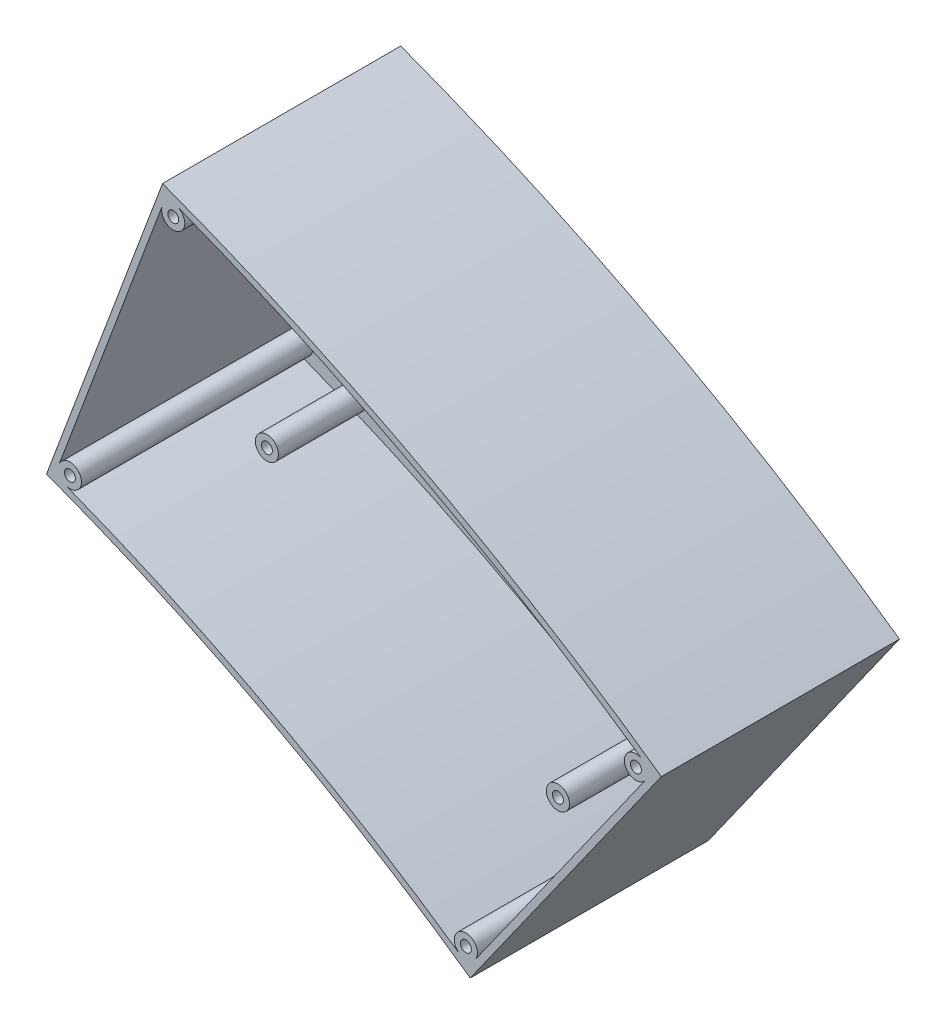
ISO-10303-21;
HEADER;
FILE_DESCRIPTION(('STEP AP214'),'2;1');
FILE_NAME('part.step','',(''),(''),'','','');
FILE_SCHEMA(('AUTOMOTIVE_DESIGN { 1 0 10303 214 1 1 1 1 }'));
ENDSEC;
DATA;
#1=APPLICATION_CONTEXT('core data for automotive mechanical design processes');
#2=APPLICATION_PROTOCOL_DEFINITION('international standard','automotive_design',2000,#1);
#3=PRODUCT_CONTEXT('',#1,'mechanical');
#4=PRODUCT('Part','Part','',(#3));
#5=PRODUCT_RELATED_PRODUCT_CATEGORY('part','',(#4));
#6=PRODUCT_DEFINITION_FORMATION('','',#4);
#7=PRODUCT_DEFINITION_CONTEXT('part definition',#1,'design');
#8=PRODUCT_DEFINITION('design','',#6,#7);
#9=PRODUCT_DEFINITION_SHAPE('','',#8);
#10=(LENGTH_UNIT() NAMED_UNIT(*) SI_UNIT(.MILLI.,.METRE.));
#11=(NAMED_UNIT(*) PLANE_ANGLE_UNIT() SI_UNIT($,.RADIAN.));
#12=(NAMED_UNIT(*) SI_UNIT($,.STERADIAN.) SOLID_ANGLE_UNIT());
#13=UNCERTAINTY_MEASURE_WITH_UNIT(LENGTH_MEASURE(1.E-05),#10,'distance_accuracy_value','');
#14=(GEOMETRIC_REPRESENTATION_CONTEXT(3) GLOBAL_UNCERTAINTY_ASSIGNED_CONTEXT((#13)) GLOBAL_UNIT_ASSIGNED_CONTEXT((#10,
#11,#12)) REPRESENTATION_CONTEXT('',''));
#15=CARTESIAN_POINT('',(0.,0.,0.));
#16=DIRECTION('',(0.,0.,1.));
#17=DIRECTION('',(1.,0.,0.));
#18=AXIS2_PLACEMENT_3D('',#15,#16,#17);
#19=CARTESIAN_POINT('',(0.,0.,0.));
#20=DIRECTION('',(0.,0.,1.));
#21=DIRECTION('',(1.,0.,0.));
#22=AXIS2_PLACEMENT_3D('',#19,#20,#21);
#23=PLANE('',#22);
#24=DIRECTION('',(0.,1.,0.));
#25=VECTOR('',#24,1.);
#26=CARTESIAN_POINT('',(303.833830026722,553.411442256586,0.));
#27=LINE('',#26,#25);
#28=CARTESIAN_POINT('',(303.833830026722,533.411442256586,0.));
#29=VERTEX_POINT('',#28);
#30=CARTESIAN_POINT('',(303.833830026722,553.411442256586,0.));
#31=VERTEX_POINT('',#30);
#32=EDGE_CURVE('E81',#29,#31,#27,.T.);
#33=ORIENTED_EDGE('',*,*,#32,.F.);
#34=DIRECTION('',(1.,0.,0.));
#35=VECTOR('',#34,1.);
#36=CARTESIAN_POINT('',(303.833830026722,533.411442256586,0.));
#37=LINE('',#36,#35);
#38=CARTESIAN_POINT('',(283.833830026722,533.411442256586,0.));
#39=VERTEX_POINT('',#38);
#40=EDGE_CURVE('E197',#39,#29,#37,.T.);
#41=ORIENTED_EDGE('',*,*,#40,.F.);
#42=DIRECTION('',(0.,-1.,0.));
#43=VECTOR('',#42,1.);
#44=CARTESIAN_POINT('',(283.833830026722,553.411442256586,0.));
#45=LINE('',#44,#43);
#46=CARTESIAN_POINT('',(283.833830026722,553.411442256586,0.));
#47=VERTEX_POINT('',#46);
#48=EDGE_CURVE('E182',#47,#39,#45,.T.);
#49=ORIENTED_EDGE('',*,*,#48,.F.);
#50=DIRECTION('',(-1.,0.,0.));
#51=VECTOR('',#50,1.);
#52=CARTESIAN_POINT('',(303.833830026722,553.411442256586,0.));
#53=LINE('',#52,#51);
#54=EDGE_CURVE('E191',#31,#47,#53,.T.);
#55=ORIENTED_EDGE('',*,*,#54,.F.);
#56=EDGE_LOOP('',(#33,#41,#49,#55));
#57=FACE_BOUND('',#56,.T.);
#58=CARTESIAN_POINT('',(326.244320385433,507.651110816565,0.));
#59=DIRECTION('',(0.,0.,1.));
#60=DIRECTION('',(1.,0.,0.));
#61=AXIS2_PLACEMENT_3D('',#58,#59,#60);
#62=CIRCLE('',#61,3.19999999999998);
#63=CARTESIAN_POINT('',(329.444320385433,507.651110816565,0.));
#64=VERTEX_POINT('',#63);
#65=EDGE_CURVE('E207',#64,#64,#62,.T.);
#66=ORIENTED_EDGE('',*,*,#65,.F.);
#67=EDGE_LOOP('',(#66));
#68=FACE_BOUND('',#67,.T.);
#69=CARTESIAN_POINT('',(237.442513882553,556.568323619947,0.));
#70=DIRECTION('',(0.,0.,1.));
#71=DIRECTION('',(1.,0.,0.));
#72=AXIS2_PLACEMENT_3D('',#69,#70,#71);
#73=CIRCLE('',#72,3.19999999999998);
#74=CARTESIAN_POINT('',(240.642513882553,556.568323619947,0.));
#75=VERTEX_POINT('',#74);
#76=EDGE_CURVE('E204',#75,#75,#73,.T.);
#77=ORIENTED_EDGE('',*,*,#76,.F.);
#78=EDGE_LOOP('',(#77));
#79=FACE_BOUND('',#78,.T.);
#80=CARTESIAN_POINT('',(234.930988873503,539.25939051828,0.));
#81=DIRECTION('',(0.,0.,1.));
#82=DIRECTION('',(1.,0.,0.));
#83=AXIS2_PLACEMENT_3D('',#80,#81,#82);
#84=CIRCLE('',#83,3.50000000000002);
#85=CARTESIAN_POINT('',(238.430988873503,539.25939051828,0.));
#86=VERTEX_POINT('',#85);
#87=EDGE_CURVE('E305',#86,#86,#84,.T.);
#88=ORIENTED_EDGE('',*,*,#87,.F.);
#89=EDGE_LOOP('',(#88));
#90=FACE_BOUND('',#89,.T.);
#91=CARTESIAN_POINT('',(258.693599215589,583.251871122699,0.));
#92=DIRECTION('',(0.,0.,1.));
#93=DIRECTION('',(1.,0.,0.));
#94=AXIS2_PLACEMENT_3D('',#91,#92,#93);
#95=CIRCLE('',#94,3.50000000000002);
#96=CARTESIAN_POINT('',(262.193599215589,583.251871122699,0.));
#97=VERTEX_POINT('',#96);
#98=EDGE_CURVE('E311',#97,#97,#95,.T.);
#99=ORIENTED_EDGE('',*,*,#98,.F.);
#100=EDGE_LOOP('',(#99));
#101=FACE_BOUND('',#100,.T.);
#102=CARTESIAN_POINT('',(322.915950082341,491.734169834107,0.));
#103=DIRECTION('',(0.,0.,1.));
#104=DIRECTION('',(1.,0.,0.));
#105=AXIS2_PLACEMENT_3D('',#102,#103,#104);
#106=CIRCLE('',#105,3.50000000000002);
#107=CARTESIAN_POINT('',(326.415950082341,491.734169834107,0.));
#108=VERTEX_POINT('',#107);
#109=EDGE_CURVE('E317',#108,#108,#106,.T.);
#110=ORIENTED_EDGE('',*,*,#109,.F.);
#111=EDGE_LOOP('',(#110));
#112=FACE_BOUND('',#111,.T.);
#113=CARTESIAN_POINT('',(346.678560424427,535.726650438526,0.));
#114=DIRECTION('',(0.,0.,1.));
#115=DIRECTION('',(1.,0.,0.));
#116=AXIS2_PLACEMENT_3D('',#113,#114,#115);
#117=CIRCLE('',#116,3.50000000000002);
#118=CARTESIAN_POINT('',(350.178560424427,535.726650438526,0.));
#119=VERTEX_POINT('',#118);
#120=EDGE_CURVE('E320',#119,#119,#117,.T.);
#121=ORIENTED_EDGE('',*,*,#120,.F.);
#122=EDGE_LOOP('',(#121));
#123=FACE_BOUND('',#122,.T.);
#124=DIRECTION('',(-0.350968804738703,-0.936387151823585,0.));
#125=VECTOR('',#124,1.);
#126=CARTESIAN_POINT('',(235.267029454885,621.995518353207,0.));
#127=LINE('',#126,#125);
#128=CARTESIAN_POINT('',(233.328651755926,616.823913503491,0.));
#129=VERTEX_POINT('',#128);
#130=CARTESIAN_POINT('',(202.091172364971,533.482106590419,0.));
#131=VERTEX_POINT('',#130);
#132=EDGE_CURVE('E342',#129,#131,#127,.T.);
#133=ORIENTED_EDGE('',*,*,#132,.T.);
#134=CARTESIAN_POINT('',(205.368527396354,532.253715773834,0.));
#135=DIRECTION('',(0.,0.,1.));
#136=DIRECTION('',(1.,0.,0.));
#137=AXIS2_PLACEMENT_3D('',#134,#135,#136);
#138=CIRCLE('',#137,3.49999999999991);
#139=CARTESIAN_POINT('',(204.108597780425,528.988355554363,0.));
#140=VERTEX_POINT('',#139);
#141=EDGE_CURVE('E244',#140,#131,#138,.T.);
#142=ORIENTED_EDGE('',*,*,#141,.F.);
#143=CARTESIAN_POINT('',(1.36002320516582E-12,3.44169137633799E-12,0.));
#144=DIRECTION('',(0.,0.,1.));
#145=DIRECTION('',(1.,0.,0.));
#146=AXIS2_PLACEMENT_3D('',#143,#144,#145);
#147=CIRCLE('',#146,566.999999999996);
#148=CARTESIAN_POINT('',(323.09941622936,465.935368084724,0.));
#149=VERTEX_POINT('',#148);
#150=EDGE_CURVE('E345',#140,#149,#147,.F.);
#151=ORIENTED_EDGE('',*,*,#150,.T.);
#152=CARTESIAN_POINT('',(325.093857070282,468.81151233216,0.));
#153=DIRECTION('',(0.,0.,1.));
#154=DIRECTION('',(1.,0.,0.));
#155=AXIS2_PLACEMENT_3D('',#152,#153,#154);
#156=CIRCLE('',#155,3.50000000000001);
#157=CARTESIAN_POINT('',(327.950639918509,466.789436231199,0.));
#158=VERTEX_POINT('',#157);
#159=EDGE_CURVE('E268',#158,#149,#156,.T.);
#160=ORIENTED_EDGE('',*,*,#159,.F.);
#161=DIRECTION('',(0.577736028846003,0.816223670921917,0.));
#162=VECTOR('',#161,1.);
#163=CARTESIAN_POINT('',(324.788408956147,462.321846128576,0.));
#164=LINE('',#163,#162);
#165=CARTESIAN_POINT('',(379.371213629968,539.436263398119,0.));
#166=VERTEX_POINT('',#165);
#167=EDGE_CURVE('E332',#158,#166,#164,.T.);
#168=ORIENTED_EDGE('',*,*,#167,.T.);
#169=CARTESIAN_POINT('',(376.514430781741,541.45833949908,0.));
#170=DIRECTION('',(0.,0.,1.));
#171=DIRECTION('',(1.,0.,0.));
#172=AXIS2_PLACEMENT_3D('',#169,#170,#171);
#173=CIRCLE('',#172,3.50000000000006);
#174=CARTESIAN_POINT('',(378.512611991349,544.331886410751,0.));
#175=VERTEX_POINT('',#174);
#176=EDGE_CURVE('E266',#175,#166,#173,.T.);
#177=ORIENTED_EDGE('',*,*,#176,.F.);
#178=CARTESIAN_POINT('',(4.05231403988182E-12,7.21644966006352E-12,0.));
#179=DIRECTION('',(0.,0.,1.));
#180=DIRECTION('',(1.,0.,0.));
#181=AXIS2_PLACEMENT_3D('',#178,#179,#180);
#182=CIRCLE('',#181,662.999999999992);
#183=CARTESIAN_POINT('',(237.861686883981,618.86251939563,0.));
#184=VERTEX_POINT('',#183);
#185=EDGE_CURVE('E326',#175,#184,#182,.T.);
#186=ORIENTED_EDGE('',*,*,#185,.T.);
#187=CARTESIAN_POINT('',(236.606006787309,615.595522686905,0.));
#188=DIRECTION('',(0.,0.,1.));
#189=DIRECTION('',(1.,0.,0.));
#190=AXIS2_PLACEMENT_3D('',#187,#188,#189);
#191=CIRCLE('',#190,3.49999999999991);
#192=EDGE_CURVE('E255',#129,#184,#191,.T.);
#193=ORIENTED_EDGE('',*,*,#192,.F.);
#194=EDGE_LOOP('',(#133,#142,#151,#160,#168,#177,#186,#193));
#195=FACE_BOUND('',#194,.T.);
#196=ADVANCED_FACE('F66',(#57,#68,#79,#90,#101,#112,#123,#195),#23,.T.);
#197=CARTESIAN_POINT('',(4.05231403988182E-12,7.21644966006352E-12,70.));
#198=DIRECTION('',(0.,0.,-1.));
#199=DIRECTION('',(-1.,0.,0.));
#200=AXIS2_PLACEMENT_3D('',#197,#198,#199);
#201=CYLINDRICAL_SURFACE('',#200,662.999999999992);
#202=CARTESIAN_POINT('',(4.05231403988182E-12,7.21644966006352E-12,70.));
#203=DIRECTION('',(0.,0.,1.));
#204=DIRECTION('',(1.,0.,0.));
#205=AXIS2_PLACEMENT_3D('',#202,#203,#204);
#206=CIRCLE('',#205,662.999999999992);
#207=CARTESIAN_POINT('',(378.512611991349,544.331886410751,70.));
#208=VERTEX_POINT('',#207);
#209=CARTESIAN_POINT('',(237.861686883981,618.86251939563,70.));
#210=VERTEX_POINT('',#209);
#211=EDGE_CURVE('E329',#208,#210,#206,.T.);
#212=ORIENTED_EDGE('',*,*,#211,.T.);
#213=DIRECTION('',(0.,0.,-1.));
#214=VECTOR('',#213,1.);
#215=CARTESIAN_POINT('',(237.861686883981,618.86251939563,70.));
#216=LINE('',#215,#214);
#217=EDGE_CURVE('E247',#210,#184,#216,.T.);
#218=ORIENTED_EDGE('',*,*,#217,.T.);
#219=ORIENTED_EDGE('',*,*,#185,.F.);
#220=DIRECTION('',(0.,0.,-1.));
#221=VECTOR('',#220,1.);
#222=CARTESIAN_POINT('',(378.512611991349,544.331886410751,70.));
#223=LINE('',#222,#221);
#224=EDGE_CURVE('E258',#208,#175,#223,.T.);
#225=ORIENTED_EDGE('',*,*,#224,.F.);
#226=EDGE_LOOP('',(#212,#218,#219,#225));
#227=FACE_BOUND('',#226,.T.);
#228=ADVANCED_FACE('F407',(#227),#201,.F.);
#229=CARTESIAN_POINT('',(235.267029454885,621.995518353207,70.));
#230=DIRECTION('',(0.936387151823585,-0.350968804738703,0.));
#231=DIRECTION('',(0.350968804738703,0.936387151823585,0.));
#232=AXIS2_PLACEMENT_3D('',#229,#230,#231);
#233=PLANE('',#232);
#234=DIRECTION('',(0.,0.,-1.));
#235=VECTOR('',#234,1.);
#236=CARTESIAN_POINT('',(202.091172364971,533.482106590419,70.));
#237=LINE('',#236,#235);
#238=CARTESIAN_POINT('',(202.091172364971,533.482106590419,70.));
#239=VERTEX_POINT('',#238);
#240=EDGE_CURVE('E241',#239,#131,#237,.T.);
#241=ORIENTED_EDGE('',*,*,#240,.T.);
#242=ORIENTED_EDGE('',*,*,#132,.F.);
#243=DIRECTION('',(0.,0.,-1.));
#244=VECTOR('',#243,1.);
#245=CARTESIAN_POINT('',(233.328651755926,616.823913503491,70.));
#246=LINE('',#245,#244);
#247=CARTESIAN_POINT('',(233.328651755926,616.823913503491,70.));
#248=VERTEX_POINT('',#247);
#249=EDGE_CURVE('E251',#248,#129,#246,.T.);
#250=ORIENTED_EDGE('',*,*,#249,.F.);
#251=DIRECTION('',(-0.350968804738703,-0.936387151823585,0.));
#252=VECTOR('',#251,1.);
#253=CARTESIAN_POINT('',(235.267029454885,621.995518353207,70.));
#254=LINE('',#253,#252);
#255=EDGE_CURVE('E331',#248,#239,#254,.T.);
#256=ORIENTED_EDGE('',*,*,#255,.T.);
#257=EDGE_LOOP('',(#241,#242,#250,#256));
#258=FACE_BOUND('',#257,.T.);
#259=ADVANCED_FACE('F412',(#258),#233,.T.);
#260=CARTESIAN_POINT('',(1.36002320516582E-12,3.44169137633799E-12,70.));
#261=DIRECTION('',(0.,0.,-1.));
#262=DIRECTION('',(-1.,0.,0.));
#263=AXIS2_PLACEMENT_3D('',#260,#261,#262);
#264=CYLINDRICAL_SURFACE('',#263,566.999999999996);
#265=DIRECTION('',(0.,0.,-1.));
#266=VECTOR('',#265,1.);
#267=CARTESIAN_POINT('',(204.108597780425,528.988355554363,70.));
#268=LINE('',#267,#266);
#269=CARTESIAN_POINT('',(204.108597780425,528.988355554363,70.));
#270=VERTEX_POINT('',#269);
#271=EDGE_CURVE('E216',#270,#140,#268,.T.);
#272=ORIENTED_EDGE('',*,*,#271,.F.);
#273=CARTESIAN_POINT('',(1.36002320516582E-12,3.44169137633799E-12,70.));
#274=DIRECTION('',(0.,0.,1.));
#275=DIRECTION('',(1.,0.,0.));
#276=AXIS2_PLACEMENT_3D('',#273,#274,#275);
#277=CIRCLE('',#276,566.999999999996);
#278=CARTESIAN_POINT('',(323.09941622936,465.935368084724,70.));
#279=VERTEX_POINT('',#278);
#280=EDGE_CURVE('E334',#270,#279,#277,.F.);
#281=ORIENTED_EDGE('',*,*,#280,.T.);
#282=DIRECTION('',(0.,0.,-1.));
#283=VECTOR('',#282,1.);
#284=CARTESIAN_POINT('',(323.09941622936,465.935368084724,70.));
#285=LINE('',#284,#283);
#286=EDGE_CURVE('E273',#279,#149,#285,.T.);
#287=ORIENTED_EDGE('',*,*,#286,.T.);
#288=ORIENTED_EDGE('',*,*,#150,.F.);
#289=EDGE_LOOP('',(#272,#281,#287,#288));
#290=FACE_BOUND('',#289,.T.);
#291=ADVANCED_FACE('F448',(#290),#264,.T.);
#292=CARTESIAN_POINT('',(324.788408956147,462.321846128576,70.));
#293=DIRECTION('',(-0.816223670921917,0.577736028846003,0.));
#294=DIRECTION('',(-0.577736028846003,-0.816223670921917,0.));
#295=AXIS2_PLACEMENT_3D('',#292,#293,#294);
#296=PLANE('',#295);
#297=DIRECTION('',(0.,0.,-1.));
#298=VECTOR('',#297,1.);
#299=CARTESIAN_POINT('',(379.371213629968,539.436263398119,70.));
#300=LINE('',#299,#298);
#301=CARTESIAN_POINT('',(379.371213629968,539.436263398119,70.));
#302=VERTEX_POINT('',#301);
#303=EDGE_CURVE('E262',#302,#166,#300,.T.);
#304=ORIENTED_EDGE('',*,*,#303,.T.);
#305=ORIENTED_EDGE('',*,*,#167,.F.);
#306=DIRECTION('',(0.,0.,-1.));
#307=VECTOR('',#306,1.);
#308=CARTESIAN_POINT('',(327.950639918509,466.789436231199,70.));
#309=LINE('',#308,#307);
#310=CARTESIAN_POINT('',(327.950639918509,466.789436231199,70.));
#311=VERTEX_POINT('',#310);
#312=EDGE_CURVE('E278',#311,#158,#309,.T.);
#313=ORIENTED_EDGE('',*,*,#312,.F.);
#314=DIRECTION('',(0.577736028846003,0.816223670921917,0.));
#315=VECTOR('',#314,1.);
#316=CARTESIAN_POINT('',(324.788408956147,462.321846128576,70.));
#317=LINE('',#316,#315);
#318=EDGE_CURVE('E336',#311,#302,#317,.T.);
#319=ORIENTED_EDGE('',*,*,#318,.T.);
#320=EDGE_LOOP('',(#304,#305,#313,#319));
#321=FACE_BOUND('',#320,.T.);
#322=ADVANCED_FACE('F444',(#321),#296,.T.);
#323=CARTESIAN_POINT('',(0.,0.,-2.));
#324=DIRECTION('',(0.,0.,1.));
#325=DIRECTION('',(1.,0.,0.));
#326=AXIS2_PLACEMENT_3D('',#323,#324,#325);
#327=CYLINDRICAL_SURFACE('',#326,565.);
#328=DIRECTION('',(0.,0.,1.));
#329=VECTOR('',#328,1.);
#330=CARTESIAN_POINT('',(326.420856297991,461.166374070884,-2.));
#331=LINE('',#330,#329);
#332=CARTESIAN_POINT('',(326.420856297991,461.166374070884,-2.));
#333=VERTEX_POINT('',#332);
#334=CARTESIAN_POINT('',(326.420856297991,461.166374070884,70.));
#335=VERTEX_POINT('',#334);
#336=EDGE_CURVE('E372',#333,#335,#331,.T.);
#337=ORIENTED_EDGE('',*,*,#336,.T.);
#338=CARTESIAN_POINT('',(1.36002320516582E-12,3.44169137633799E-12,70.));
#339=DIRECTION('',(0.,0.,-1.));
#340=DIRECTION('',(-1.,0.,0.));
#341=AXIS2_PLACEMENT_3D('',#338,#339,#340);
#342=CIRCLE('',#341,564.999999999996);
#343=CARTESIAN_POINT('',(198.297374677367,529.058740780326,70.));
#344=VERTEX_POINT('',#343);
#345=EDGE_CURVE('E354',#344,#335,#342,.T.);
#346=ORIENTED_EDGE('',*,*,#345,.F.);
#347=DIRECTION('',(0.,0.,1.));
#348=VECTOR('',#347,1.);
#349=CARTESIAN_POINT('',(198.297374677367,529.058740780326,-2.));
#350=LINE('',#349,#348);
#351=CARTESIAN_POINT('',(198.297374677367,529.058740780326,-2.));
#352=VERTEX_POINT('',#351);
#353=EDGE_CURVE('E373',#352,#344,#350,.T.);
#354=ORIENTED_EDGE('',*,*,#353,.F.);
#355=CARTESIAN_POINT('',(0.,0.,-2.));
#356=DIRECTION('',(0.,0.,-1.));
#357=DIRECTION('',(1.,0.,0.));
#358=AXIS2_PLACEMENT_3D('',#355,#356,#357);
#359=CIRCLE('',#358,565.);
#360=EDGE_CURVE('E360',#352,#333,#359,.T.);
#361=ORIENTED_EDGE('',*,*,#360,.T.);
#362=EDGE_LOOP('',(#337,#346,#354,#361));
#363=FACE_BOUND('',#362,.T.);
#364=ADVANCED_FACE('F68',(#363),#327,.F.);
#365=CARTESIAN_POINT('',(198.297374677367,529.058740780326,-2.));
#366=DIRECTION('',(-0.936387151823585,0.350968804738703,0.));
#367=DIRECTION('',(-0.350968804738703,-0.936387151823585,0.));
#368=AXIS2_PLACEMENT_3D('',#365,#366,#367);
#369=PLANE('',#368);
#370=ORIENTED_EDGE('',*,*,#353,.T.);
#371=DIRECTION('',(-0.350968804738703,-0.936387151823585,0.));
#372=VECTOR('',#371,1.);
#373=CARTESIAN_POINT('',(233.394255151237,622.697455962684,70.));
#374=LINE('',#373,#372);
#375=CARTESIAN_POINT('',(233.394255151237,622.697455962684,70.));
#376=VERTEX_POINT('',#375);
#377=EDGE_CURVE('E351',#376,#344,#374,.T.);
#378=ORIENTED_EDGE('',*,*,#377,.F.);
#379=DIRECTION('',(0.,0.,1.));
#380=VECTOR('',#379,1.);
#381=CARTESIAN_POINT('',(233.394255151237,622.697455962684,-2.));
#382=LINE('',#381,#380);
#383=CARTESIAN_POINT('',(233.394255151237,622.697455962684,-2.));
#384=VERTEX_POINT('',#383);
#385=EDGE_CURVE('E376',#384,#376,#382,.T.);
#386=ORIENTED_EDGE('',*,*,#385,.F.);
#387=DIRECTION('',(-0.350968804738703,-0.936387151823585,0.));
#388=VECTOR('',#387,1.);
#389=CARTESIAN_POINT('',(198.297374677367,529.058740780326,-2.));
#390=LINE('',#389,#388);
#391=EDGE_CURVE('E369',#384,#352,#390,.T.);
#392=ORIENTED_EDGE('',*,*,#391,.T.);
#393=EDGE_LOOP('',(#370,#378,#386,#392));
#394=FACE_BOUND('',#393,.T.);
#395=ADVANCED_FACE('F418',(#394),#369,.T.);
#396=CARTESIAN_POINT('',(0.,0.,-2.));
#397=DIRECTION('',(0.,0.,1.));
#398=DIRECTION('',(1.,0.,0.));
#399=AXIS2_PLACEMENT_3D('',#396,#397,#398);
#400=CYLINDRICAL_SURFACE('',#399,665.);
#401=ORIENTED_EDGE('',*,*,#385,.T.);
#402=CARTESIAN_POINT('',(4.05231403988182E-12,7.21644966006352E-12,70.));
#403=DIRECTION('',(0.,0.,1.));
#404=DIRECTION('',(1.,0.,0.));
#405=AXIS2_PLACEMENT_3D('',#402,#403,#404);
#406=CIRCLE('',#405,664.999999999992);
#407=CARTESIAN_POINT('',(384.194459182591,542.788741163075,70.));
#408=VERTEX_POINT('',#407);
#409=EDGE_CURVE('E339',#408,#376,#406,.T.);
#410=ORIENTED_EDGE('',*,*,#409,.F.);
#411=DIRECTION('',(0.,0.,1.));
#412=VECTOR('',#411,1.);
#413=CARTESIAN_POINT('',(384.194459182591,542.788741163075,-2.));
#414=LINE('',#413,#412);
#415=CARTESIAN_POINT('',(384.194459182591,542.788741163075,-2.));
#416=VERTEX_POINT('',#415);
#417=EDGE_CURVE('E378',#416,#408,#414,.T.);
#418=ORIENTED_EDGE('',*,*,#417,.F.);
#419=CARTESIAN_POINT('',(0.,0.,-2.));
#420=DIRECTION('',(0.,0.,1.));
#421=DIRECTION('',(1.,0.,0.));
#422=AXIS2_PLACEMENT_3D('',#419,#420,#421);
#423=CIRCLE('',#422,665.);
#424=EDGE_CURVE('E366',#416,#384,#423,.T.);
#425=ORIENTED_EDGE('',*,*,#424,.T.);
#426=EDGE_LOOP('',(#401,#410,#418,#425));
#427=FACE_BOUND('',#426,.T.);
#428=ADVANCED_FACE('F421',(#427),#400,.T.);
#429=CARTESIAN_POINT('',(326.420856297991,461.166374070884,-2.));
#430=DIRECTION('',(0.816223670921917,-0.577736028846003,0.));
#431=DIRECTION('',(0.577736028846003,0.816223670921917,0.));
#432=AXIS2_PLACEMENT_3D('',#429,#430,#431);
#433=PLANE('',#432);
#434=ORIENTED_EDGE('',*,*,#417,.T.);
#435=DIRECTION('',(0.577736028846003,0.816223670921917,0.));
#436=VECTOR('',#435,1.);
#437=CARTESIAN_POINT('',(326.420856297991,461.166374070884,70.));
#438=LINE('',#437,#436);
#439=EDGE_CURVE('E357',#335,#408,#438,.T.);
#440=ORIENTED_EDGE('',*,*,#439,.F.);
#441=ORIENTED_EDGE('',*,*,#336,.F.);
#442=DIRECTION('',(0.577736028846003,0.816223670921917,0.));
#443=VECTOR('',#442,1.);
#444=CARTESIAN_POINT('',(326.420856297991,461.166374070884,-2.));
#445=LINE('',#444,#443);
#446=EDGE_CURVE('E363',#333,#416,#445,.T.);
#447=ORIENTED_EDGE('',*,*,#446,.T.);
#448=EDGE_LOOP('',(#434,#440,#441,#447));
#449=FACE_BOUND('',#448,.T.);
#450=ADVANCED_FACE('F424',(#449),#433,.T.);
#451=CARTESIAN_POINT('',(0.,0.,-2.));
#452=DIRECTION('',(0.,0.,1.));
#453=DIRECTION('',(1.,0.,0.));
#454=AXIS2_PLACEMENT_3D('',#451,#452,#453);
#455=PLANE('',#454);
#456=DIRECTION('',(1.,0.,0.));
#457=VECTOR('',#456,1.);
#458=CARTESIAN_POINT('',(0.,533.411442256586,-2.));
#459=LINE('',#458,#457);
#460=CARTESIAN_POINT('',(283.833830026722,533.411442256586,-2.));
#461=VERTEX_POINT('',#460);
#462=CARTESIAN_POINT('',(303.833830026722,533.411442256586,-2.));
#463=VERTEX_POINT('',#462);
#464=EDGE_CURVE('E74',#461,#463,#459,.T.);
#465=ORIENTED_EDGE('',*,*,#464,.T.);
#466=DIRECTION('',(0.,1.,0.));
#467=VECTOR('',#466,1.);
#468=CARTESIAN_POINT('',(303.833830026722,0.,-2.));
#469=LINE('',#468,#467);
#470=CARTESIAN_POINT('',(303.833830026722,553.411442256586,-2.));
#471=VERTEX_POINT('',#470);
#472=EDGE_CURVE('E12',#463,#471,#469,.T.);
#473=ORIENTED_EDGE('',*,*,#472,.T.);
#474=DIRECTION('',(-1.,0.,0.));
#475=VECTOR('',#474,1.);
#476=CARTESIAN_POINT('',(0.,553.411442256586,-2.));
#477=LINE('',#476,#475);
#478=CARTESIAN_POINT('',(283.833830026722,553.411442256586,-2.));
#479=VERTEX_POINT('',#478);
#480=EDGE_CURVE('E375',#471,#479,#477,.T.);
#481=ORIENTED_EDGE('',*,*,#480,.T.);
#482=DIRECTION('',(0.,-1.,0.));
#483=VECTOR('',#482,1.);
#484=CARTESIAN_POINT('',(283.833830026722,0.,-2.));
#485=LINE('',#484,#483);
#486=EDGE_CURVE('E185',#479,#461,#485,.T.);
#487=ORIENTED_EDGE('',*,*,#486,.T.);
#488=EDGE_LOOP('',(#465,#473,#481,#487));
#489=FACE_BOUND('',#488,.T.);
#490=CARTESIAN_POINT('',(326.244320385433,507.651110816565,-2.));
#491=DIRECTION('',(0.,0.,1.));
#492=DIRECTION('',(1.,0.,0.));
#493=AXIS2_PLACEMENT_3D('',#490,#491,#492);
#494=CIRCLE('',#493,3.19999999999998);
#495=CARTESIAN_POINT('',(329.444320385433,507.651110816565,-2.));
#496=VERTEX_POINT('',#495);
#497=EDGE_CURVE('E238',#496,#496,#494,.T.);
#498=ORIENTED_EDGE('',*,*,#497,.T.);
#499=EDGE_LOOP('',(#498));
#500=FACE_BOUND('',#499,.T.);
#501=CARTESIAN_POINT('',(237.442513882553,556.568323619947,-2.));
#502=DIRECTION('',(0.,0.,1.));
#503=DIRECTION('',(1.,0.,0.));
#504=AXIS2_PLACEMENT_3D('',#501,#502,#503);
#505=CIRCLE('',#504,3.19999999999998);
#506=CARTESIAN_POINT('',(240.642513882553,556.568323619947,-2.));
#507=VERTEX_POINT('',#506);
#508=EDGE_CURVE('E210',#507,#507,#505,.T.);
#509=ORIENTED_EDGE('',*,*,#508,.T.);
#510=EDGE_LOOP('',(#509));
#511=FACE_BOUND('',#510,.T.);
#512=ORIENTED_EDGE('',*,*,#360,.F.);
#513=ORIENTED_EDGE('',*,*,#391,.F.);
#514=ORIENTED_EDGE('',*,*,#424,.F.);
#515=ORIENTED_EDGE('',*,*,#446,.F.);
#516=EDGE_LOOP('',(#512,#513,#514,#515));
#517=FACE_BOUND('',#516,.T.);
#518=ADVANCED_FACE('F388',(#489,#500,#511,#517),#455,.F.);
#519=CARTESIAN_POINT('',(4.05231403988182E-12,7.21644966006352E-12,70.));
#520=DIRECTION('',(0.,0.,1.));
#521=DIRECTION('',(1.,0.,0.));
#522=AXIS2_PLACEMENT_3D('',#519,#520,#521);
#523=PLANE('',#522);
#524=CARTESIAN_POINT('',(236.606006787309,615.595522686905,70.));
#525=DIRECTION('',(0.,0.,1.));
#526=DIRECTION('',(1.,0.,0.));
#527=AXIS2_PLACEMENT_3D('',#524,#525,#526);
#528=CIRCLE('',#527,1.65000000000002);
#529=CARTESIAN_POINT('',(238.256006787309,615.595522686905,70.));
#530=VERTEX_POINT('',#529);
#531=EDGE_CURVE('E217',#530,#530,#528,.T.);
#532=ORIENTED_EDGE('',*,*,#531,.F.);
#533=EDGE_LOOP('',(#532));
#534=FACE_BOUND('',#533,.T.);
#535=CARTESIAN_POINT('',(376.514430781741,541.45833949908,70.));
#536=DIRECTION('',(0.,0.,1.));
#537=DIRECTION('',(1.,0.,0.));
#538=AXIS2_PLACEMENT_3D('',#535,#536,#537);
#539=CIRCLE('',#538,1.65000000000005);
#540=CARTESIAN_POINT('',(378.164430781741,541.45833949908,70.));
#541=VERTEX_POINT('',#540);
#542=EDGE_CURVE('E220',#541,#541,#539,.T.);
#543=ORIENTED_EDGE('',*,*,#542,.F.);
#544=EDGE_LOOP('',(#543));
#545=FACE_BOUND('',#544,.T.);
#546=CARTESIAN_POINT('',(205.368527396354,532.253715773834,70.));
#547=DIRECTION('',(0.,0.,1.));
#548=DIRECTION('',(1.,0.,0.));
#549=AXIS2_PLACEMENT_3D('',#546,#547,#548);
#550=CIRCLE('',#549,1.65000000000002);
#551=CARTESIAN_POINT('',(207.018527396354,532.253715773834,70.));
#552=VERTEX_POINT('',#551);
#553=EDGE_CURVE('E226',#552,#552,#550,.T.);
#554=ORIENTED_EDGE('',*,*,#553,.F.);
#555=EDGE_LOOP('',(#554));
#556=FACE_BOUND('',#555,.T.);
#557=CARTESIAN_POINT('',(325.093857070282,468.81151233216,70.));
#558=DIRECTION('',(0.,0.,1.));
#559=DIRECTION('',(1.,0.,0.));
#560=AXIS2_PLACEMENT_3D('',#557,#558,#559);
#561=CIRCLE('',#560,1.65000000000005);
#562=CARTESIAN_POINT('',(326.743857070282,468.81151233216,70.));
#563=VERTEX_POINT('',#562);
#564=EDGE_CURVE('E232',#563,#563,#561,.T.);
#565=ORIENTED_EDGE('',*,*,#564,.F.);
#566=EDGE_LOOP('',(#565));
#567=FACE_BOUND('',#566,.T.);
#568=ORIENTED_EDGE('',*,*,#280,.F.);
#569=CARTESIAN_POINT('',(205.368527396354,532.253715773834,70.));
#570=DIRECTION('',(0.,0.,1.));
#571=DIRECTION('',(1.,0.,0.));
#572=AXIS2_PLACEMENT_3D('',#569,#570,#571);
#573=CIRCLE('',#572,3.49999999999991);
#574=EDGE_CURVE('E243',#270,#239,#573,.T.);
#575=ORIENTED_EDGE('',*,*,#574,.T.);
#576=ORIENTED_EDGE('',*,*,#255,.F.);
#577=CARTESIAN_POINT('',(236.606006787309,615.595522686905,70.));
#578=DIRECTION('',(0.,0.,1.));
#579=DIRECTION('',(1.,0.,0.));
#580=AXIS2_PLACEMENT_3D('',#577,#578,#579);
#581=CIRCLE('',#580,3.49999999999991);
#582=EDGE_CURVE('E254',#248,#210,#581,.T.);
#583=ORIENTED_EDGE('',*,*,#582,.T.);
#584=ORIENTED_EDGE('',*,*,#211,.F.);
#585=CARTESIAN_POINT('',(376.514430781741,541.45833949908,70.));
#586=DIRECTION('',(0.,0.,1.));
#587=DIRECTION('',(1.,0.,0.));
#588=AXIS2_PLACEMENT_3D('',#585,#586,#587);
#589=CIRCLE('',#588,3.50000000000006);
#590=EDGE_CURVE('E265',#208,#302,#589,.T.);
#591=ORIENTED_EDGE('',*,*,#590,.T.);
#592=ORIENTED_EDGE('',*,*,#318,.F.);
#593=CARTESIAN_POINT('',(325.093857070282,468.81151233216,70.));
#594=DIRECTION('',(0.,0.,1.));
#595=DIRECTION('',(1.,0.,0.));
#596=AXIS2_PLACEMENT_3D('',#593,#594,#595);
#597=CIRCLE('',#596,3.50000000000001);
#598=EDGE_CURVE('E270',#311,#279,#597,.T.);
#599=ORIENTED_EDGE('',*,*,#598,.T.);
#600=EDGE_LOOP('',(#568,#575,#576,#583,#584,#591,#592,#599));
#601=FACE_BOUND('',#600,.T.);
#602=ORIENTED_EDGE('',*,*,#409,.T.);
#603=ORIENTED_EDGE('',*,*,#377,.T.);
#604=ORIENTED_EDGE('',*,*,#345,.T.);
#605=ORIENTED_EDGE('',*,*,#439,.T.);
#606=EDGE_LOOP('',(#602,#603,#604,#605));
#607=FACE_BOUND('',#606,.T.);
#608=ADVANCED_FACE('F431',(#534,#545,#556,#567,#601,#607),#523,.T.);
#609=CARTESIAN_POINT('',(346.678560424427,535.726650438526,40.));
#610=DIRECTION('',(0.,0.,-1.));
#611=DIRECTION('',(-1.,0.,0.));
#612=AXIS2_PLACEMENT_3D('',#609,#610,#611);
#613=CYLINDRICAL_SURFACE('',#612,3.50000000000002);
#614=CARTESIAN_POINT('',(346.678560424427,535.726650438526,40.));
#615=DIRECTION('',(0.,0.,1.));
#616=DIRECTION('',(1.,0.,0.));
#617=AXIS2_PLACEMENT_3D('',#614,#615,#616);
#618=CIRCLE('',#617,3.50000000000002);
#619=CARTESIAN_POINT('',(350.178560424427,535.726650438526,40.));
#620=VERTEX_POINT('',#619);
#621=EDGE_CURVE('E323',#620,#620,#618,.T.);
#622=ORIENTED_EDGE('',*,*,#621,.F.);
#623=EDGE_LOOP('',(#622));
#624=FACE_BOUND('',#623,.T.);
#625=ORIENTED_EDGE('',*,*,#120,.T.);
#626=EDGE_LOOP('',(#625));
#627=FACE_BOUND('',#626,.T.);
#628=ADVANCED_FACE('F457',(#624,#627),#613,.T.);
#629=CARTESIAN_POINT('',(346.678560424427,535.726650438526,40.));
#630=DIRECTION('',(0.,0.,1.));
#631=DIRECTION('',(1.,0.,0.));
#632=AXIS2_PLACEMENT_3D('',#629,#630,#631);
#633=PLANE('',#632);
#634=CARTESIAN_POINT('',(346.678560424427,535.726650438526,40.));
#635=DIRECTION('',(0.,0.,1.));
#636=DIRECTION('',(1.,0.,0.));
#637=AXIS2_PLACEMENT_3D('',#634,#635,#636);
#638=CIRCLE('',#637,1.64999999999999);
#639=CARTESIAN_POINT('',(348.328560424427,535.726650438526,40.));
#640=VERTEX_POINT('',#639);
#641=EDGE_CURVE('E285',#640,#640,#638,.T.);
#642=ORIENTED_EDGE('',*,*,#641,.F.);
#643=EDGE_LOOP('',(#642));
#644=FACE_BOUND('',#643,.T.);
#645=ORIENTED_EDGE('',*,*,#621,.T.);
#646=EDGE_LOOP('',(#645));
#647=FACE_BOUND('',#646,.T.);
#648=ADVANCED_FACE('F467',(#644,#647),#633,.T.);
#649=CARTESIAN_POINT('',(322.915950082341,491.734169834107,40.));
#650=DIRECTION('',(0.,0.,-1.));
#651=DIRECTION('',(-1.,0.,0.));
#652=AXIS2_PLACEMENT_3D('',#649,#650,#651);
#653=CYLINDRICAL_SURFACE('',#652,3.50000000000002);
#654=CARTESIAN_POINT('',(322.915950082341,491.734169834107,40.));
#655=DIRECTION('',(0.,0.,1.));
#656=DIRECTION('',(1.,0.,0.));
#657=AXIS2_PLACEMENT_3D('',#654,#655,#656);
#658=CIRCLE('',#657,3.50000000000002);
#659=CARTESIAN_POINT('',(326.415950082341,491.734169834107,40.));
#660=VERTEX_POINT('',#659);
#661=EDGE_CURVE('E314',#660,#660,#658,.T.);
#662=ORIENTED_EDGE('',*,*,#661,.F.);
#663=EDGE_LOOP('',(#662));
#664=FACE_BOUND('',#663,.T.);
#665=ORIENTED_EDGE('',*,*,#109,.T.);
#666=EDGE_LOOP('',(#665));
#667=FACE_BOUND('',#666,.T.);
#668=ADVANCED_FACE('F561',(#664,#667),#653,.T.);
#669=CARTESIAN_POINT('',(322.915950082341,491.734169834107,40.));
#670=DIRECTION('',(0.,0.,1.));
#671=DIRECTION('',(1.,0.,0.));
#672=AXIS2_PLACEMENT_3D('',#669,#670,#671);
#673=PLANE('',#672);
#674=CARTESIAN_POINT('',(322.915950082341,491.734169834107,40.));
#675=DIRECTION('',(0.,0.,1.));
#676=DIRECTION('',(1.,0.,0.));
#677=AXIS2_PLACEMENT_3D('',#674,#675,#676);
#678=CIRCLE('',#677,1.64999999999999);
#679=CARTESIAN_POINT('',(324.565950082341,491.734169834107,40.));
#680=VERTEX_POINT('',#679);
#681=EDGE_CURVE('E288',#680,#680,#678,.T.);
#682=ORIENTED_EDGE('',*,*,#681,.F.);
#683=EDGE_LOOP('',(#682));
#684=FACE_BOUND('',#683,.T.);
#685=ORIENTED_EDGE('',*,*,#661,.T.);
#686=EDGE_LOOP('',(#685));
#687=FACE_BOUND('',#686,.T.);
#688=ADVANCED_FACE('F556',(#684,#687),#673,.T.);
#689=CARTESIAN_POINT('',(258.693599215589,583.251871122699,40.));
#690=DIRECTION('',(0.,0.,-1.));
#691=DIRECTION('',(-1.,0.,0.));
#692=AXIS2_PLACEMENT_3D('',#689,#690,#691);
#693=CYLINDRICAL_SURFACE('',#692,3.50000000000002);
#694=CARTESIAN_POINT('',(258.693599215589,583.251871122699,40.));
#695=DIRECTION('',(0.,0.,1.));
#696=DIRECTION('',(1.,0.,0.));
#697=AXIS2_PLACEMENT_3D('',#694,#695,#696);
#698=CIRCLE('',#697,3.50000000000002);
#699=CARTESIAN_POINT('',(262.193599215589,583.251871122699,40.));
#700=VERTEX_POINT('',#699);
#701=EDGE_CURVE('E308',#700,#700,#698,.T.);
#702=ORIENTED_EDGE('',*,*,#701,.F.);
#703=EDGE_LOOP('',(#702));
#704=FACE_BOUND('',#703,.T.);
#705=ORIENTED_EDGE('',*,*,#98,.T.);
#706=EDGE_LOOP('',(#705));
#707=FACE_BOUND('',#706,.T.);
#708=ADVANCED_FACE('F553',(#704,#707),#693,.T.);
#709=CARTESIAN_POINT('',(258.693599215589,583.251871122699,40.));
#710=DIRECTION('',(0.,0.,1.));
#711=DIRECTION('',(1.,0.,0.));
#712=AXIS2_PLACEMENT_3D('',#709,#710,#711);
#713=PLANE('',#712);
#714=CARTESIAN_POINT('',(258.693599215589,583.251871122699,40.));
#715=DIRECTION('',(0.,0.,1.));
#716=DIRECTION('',(1.,0.,0.));
#717=AXIS2_PLACEMENT_3D('',#714,#715,#716);
#718=CIRCLE('',#717,1.64999999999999);
#719=CARTESIAN_POINT('',(260.343599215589,583.251871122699,40.));
#720=VERTEX_POINT('',#719);
#721=EDGE_CURVE('E294',#720,#720,#718,.T.);
#722=ORIENTED_EDGE('',*,*,#721,.F.);
#723=EDGE_LOOP('',(#722));
#724=FACE_BOUND('',#723,.T.);
#725=ORIENTED_EDGE('',*,*,#701,.T.);
#726=EDGE_LOOP('',(#725));
#727=FACE_BOUND('',#726,.T.);
#728=ADVANCED_FACE('F548',(#724,#727),#713,.T.);
#729=CARTESIAN_POINT('',(234.930988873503,539.25939051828,40.));
#730=DIRECTION('',(0.,0.,-1.));
#731=DIRECTION('',(-1.,0.,0.));
#732=AXIS2_PLACEMENT_3D('',#729,#730,#731);
#733=CYLINDRICAL_SURFACE('',#732,3.50000000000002);
#734=CARTESIAN_POINT('',(234.930988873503,539.25939051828,40.));
#735=DIRECTION('',(0.,0.,1.));
#736=DIRECTION('',(1.,0.,0.));
#737=AXIS2_PLACEMENT_3D('',#734,#735,#736);
#738=CIRCLE('',#737,3.50000000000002);
#739=CARTESIAN_POINT('',(238.430988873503,539.25939051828,40.));
#740=VERTEX_POINT('',#739);
#741=EDGE_CURVE('E284',#740,#740,#738,.T.);
#742=ORIENTED_EDGE('',*,*,#741,.F.);
#743=EDGE_LOOP('',(#742));
#744=FACE_BOUND('',#743,.T.);
#745=ORIENTED_EDGE('',*,*,#87,.T.);
#746=EDGE_LOOP('',(#745));
#747=FACE_BOUND('',#746,.T.);
#748=ADVANCED_FACE('F545',(#744,#747),#733,.T.);
#749=CARTESIAN_POINT('',(234.930988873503,539.25939051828,40.));
#750=DIRECTION('',(0.,0.,1.));
#751=DIRECTION('',(1.,0.,0.));
#752=AXIS2_PLACEMENT_3D('',#749,#750,#751);
#753=PLANE('',#752);
#754=CARTESIAN_POINT('',(234.930988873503,539.25939051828,40.));
#755=DIRECTION('',(0.,0.,1.));
#756=DIRECTION('',(1.,0.,0.));
#757=AXIS2_PLACEMENT_3D('',#754,#755,#756);
#758=CIRCLE('',#757,1.64999999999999);
#759=CARTESIAN_POINT('',(236.580988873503,539.25939051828,40.));
#760=VERTEX_POINT('',#759);
#761=EDGE_CURVE('E300',#760,#760,#758,.T.);
#762=ORIENTED_EDGE('',*,*,#761,.F.);
#763=EDGE_LOOP('',(#762));
#764=FACE_BOUND('',#763,.T.);
#765=ORIENTED_EDGE('',*,*,#741,.T.);
#766=EDGE_LOOP('',(#765));
#767=FACE_BOUND('',#766,.T.);
#768=ADVANCED_FACE('F540',(#764,#767),#753,.T.);
#769=CARTESIAN_POINT('',(234.930988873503,539.25939051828,20.));
#770=DIRECTION('',(0.,0.,1.));
#771=DIRECTION('',(1.,0.,0.));
#772=AXIS2_PLACEMENT_3D('',#769,#770,#771);
#773=CYLINDRICAL_SURFACE('',#772,1.64999999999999);
#774=CARTESIAN_POINT('',(234.930988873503,539.25939051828,20.));
#775=DIRECTION('',(0.,0.,1.));
#776=DIRECTION('',(1.,0.,0.));
#777=AXIS2_PLACEMENT_3D('',#774,#775,#776);
#778=CIRCLE('',#777,1.64999999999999);
#779=CARTESIAN_POINT('',(236.580988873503,539.25939051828,20.));
#780=VERTEX_POINT('',#779);
#781=EDGE_CURVE('E280',#780,#780,#778,.T.);
#782=ORIENTED_EDGE('',*,*,#781,.F.);
#783=EDGE_LOOP('',(#782));
#784=FACE_BOUND('',#783,.T.);
#785=ORIENTED_EDGE('',*,*,#761,.T.);
#786=EDGE_LOOP('',(#785));
#787=FACE_BOUND('',#786,.T.);
#788=ADVANCED_FACE('F537',(#784,#787),#773,.F.);
#789=CARTESIAN_POINT('',(234.930988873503,539.25939051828,20.));
#790=DIRECTION('',(0.,0.,1.));
#791=DIRECTION('',(1.,0.,0.));
#792=AXIS2_PLACEMENT_3D('',#789,#790,#791);
#793=PLANE('',#792);
#794=ORIENTED_EDGE('',*,*,#781,.T.);
#795=EDGE_LOOP('',(#794));
#796=FACE_BOUND('',#795,.T.);
#797=ADVANCED_FACE('F532',(#796),#793,.T.);
#798=CARTESIAN_POINT('',(258.693599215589,583.251871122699,20.));
#799=DIRECTION('',(0.,0.,1.));
#800=DIRECTION('',(1.,0.,0.));
#801=AXIS2_PLACEMENT_3D('',#798,#799,#800);
#802=CYLINDRICAL_SURFACE('',#801,1.64999999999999);
#803=CARTESIAN_POINT('',(258.693599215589,583.251871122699,20.));
#804=DIRECTION('',(0.,0.,1.));
#805=DIRECTION('',(1.,0.,0.));
#806=AXIS2_PLACEMENT_3D('',#803,#804,#805);
#807=CIRCLE('',#806,1.64999999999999);
#808=CARTESIAN_POINT('',(260.343599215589,583.251871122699,20.));
#809=VERTEX_POINT('',#808);
#810=EDGE_CURVE('E297',#809,#809,#807,.T.);
#811=ORIENTED_EDGE('',*,*,#810,.F.);
#812=EDGE_LOOP('',(#811));
#813=FACE_BOUND('',#812,.T.);
#814=ORIENTED_EDGE('',*,*,#721,.T.);
#815=EDGE_LOOP('',(#814));
#816=FACE_BOUND('',#815,.T.);
#817=ADVANCED_FACE('F529',(#813,#816),#802,.F.);
#818=CARTESIAN_POINT('',(258.693599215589,583.251871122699,20.));
#819=DIRECTION('',(0.,0.,1.));
#820=DIRECTION('',(1.,0.,0.));
#821=AXIS2_PLACEMENT_3D('',#818,#819,#820);
#822=PLANE('',#821);
#823=ORIENTED_EDGE('',*,*,#810,.T.);
#824=EDGE_LOOP('',(#823));
#825=FACE_BOUND('',#824,.T.);
#826=ADVANCED_FACE('F524',(#825),#822,.T.);
#827=CARTESIAN_POINT('',(322.915950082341,491.734169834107,20.));
#828=DIRECTION('',(0.,0.,1.));
#829=DIRECTION('',(1.,0.,0.));
#830=AXIS2_PLACEMENT_3D('',#827,#828,#829);
#831=CYLINDRICAL_SURFACE('',#830,1.64999999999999);
#832=CARTESIAN_POINT('',(322.915950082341,491.734169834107,20.));
#833=DIRECTION('',(0.,0.,1.));
#834=DIRECTION('',(1.,0.,0.));
#835=AXIS2_PLACEMENT_3D('',#832,#833,#834);
#836=CIRCLE('',#835,1.64999999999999);
#837=CARTESIAN_POINT('',(324.565950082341,491.734169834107,20.));
#838=VERTEX_POINT('',#837);
#839=EDGE_CURVE('E291',#838,#838,#836,.T.);
#840=ORIENTED_EDGE('',*,*,#839,.F.);
#841=EDGE_LOOP('',(#840));
#842=FACE_BOUND('',#841,.T.);
#843=ORIENTED_EDGE('',*,*,#681,.T.);
#844=EDGE_LOOP('',(#843));
#845=FACE_BOUND('',#844,.T.);
#846=ADVANCED_FACE('F521',(#842,#845),#831,.F.);
#847=CARTESIAN_POINT('',(322.915950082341,491.734169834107,20.));
#848=DIRECTION('',(0.,0.,1.));
#849=DIRECTION('',(1.,0.,0.));
#850=AXIS2_PLACEMENT_3D('',#847,#848,#849);
#851=PLANE('',#850);
#852=ORIENTED_EDGE('',*,*,#839,.T.);
#853=EDGE_LOOP('',(#852));
#854=FACE_BOUND('',#853,.T.);
#855=ADVANCED_FACE('F519',(#854),#851,.T.);
#856=CARTESIAN_POINT('',(346.678560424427,535.726650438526,20.));
#857=DIRECTION('',(0.,0.,1.));
#858=DIRECTION('',(1.,0.,0.));
#859=AXIS2_PLACEMENT_3D('',#856,#857,#858);
#860=CYLINDRICAL_SURFACE('',#859,1.64999999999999);
#861=CARTESIAN_POINT('',(346.678560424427,535.726650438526,20.));
#862=DIRECTION('',(0.,0.,1.));
#863=DIRECTION('',(1.,0.,0.));
#864=AXIS2_PLACEMENT_3D('',#861,#862,#863);
#865=CIRCLE('',#864,1.64999999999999);
#866=CARTESIAN_POINT('',(348.328560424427,535.726650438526,20.));
#867=VERTEX_POINT('',#866);
#868=EDGE_CURVE('E281',#867,#867,#865,.T.);
#869=ORIENTED_EDGE('',*,*,#868,.F.);
#870=EDGE_LOOP('',(#869));
#871=FACE_BOUND('',#870,.T.);
#872=ORIENTED_EDGE('',*,*,#641,.T.);
#873=EDGE_LOOP('',(#872));
#874=FACE_BOUND('',#873,.T.);
#875=ADVANCED_FACE('F512',(#871,#874),#860,.F.);
#876=CARTESIAN_POINT('',(346.678560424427,535.726650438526,20.));
#877=DIRECTION('',(0.,0.,1.));
#878=DIRECTION('',(1.,0.,0.));
#879=AXIS2_PLACEMENT_3D('',#876,#877,#878);
#880=PLANE('',#879);
#881=ORIENTED_EDGE('',*,*,#868,.T.);
#882=EDGE_LOOP('',(#881));
#883=FACE_BOUND('',#882,.T.);
#884=ADVANCED_FACE('F505',(#883),#880,.T.);
#885=CARTESIAN_POINT('',(325.093857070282,468.81151233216,70.));
#886=DIRECTION('',(0.,0.,-1.));
#887=DIRECTION('',(-1.,0.,0.));
#888=AXIS2_PLACEMENT_3D('',#885,#886,#887);
#889=CYLINDRICAL_SURFACE('',#888,3.50000000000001);
#890=ORIENTED_EDGE('',*,*,#159,.T.);
#891=ORIENTED_EDGE('',*,*,#286,.F.);
#892=ORIENTED_EDGE('',*,*,#598,.F.);
#893=ORIENTED_EDGE('',*,*,#312,.T.);
#894=EDGE_LOOP('',(#890,#891,#892,#893));
#895=FACE_BOUND('',#894,.T.);
#896=ADVANCED_FACE('F503',(#895),#889,.T.);
#897=CARTESIAN_POINT('',(376.514430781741,541.45833949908,70.));
#898=DIRECTION('',(0.,0.,-1.));
#899=DIRECTION('',(-1.,0.,0.));
#900=AXIS2_PLACEMENT_3D('',#897,#898,#899);
#901=CYLINDRICAL_SURFACE('',#900,3.50000000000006);
#902=ORIENTED_EDGE('',*,*,#176,.T.);
#903=ORIENTED_EDGE('',*,*,#303,.F.);
#904=ORIENTED_EDGE('',*,*,#590,.F.);
#905=ORIENTED_EDGE('',*,*,#224,.T.);
#906=EDGE_LOOP('',(#902,#903,#904,#905));
#907=FACE_BOUND('',#906,.T.);
#908=ADVANCED_FACE('F498',(#907),#901,.T.);
#909=CARTESIAN_POINT('',(236.606006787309,615.595522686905,70.));
#910=DIRECTION('',(0.,0.,-1.));
#911=DIRECTION('',(-1.,0.,0.));
#912=AXIS2_PLACEMENT_3D('',#909,#910,#911);
#913=CYLINDRICAL_SURFACE('',#912,3.49999999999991);
#914=ORIENTED_EDGE('',*,*,#192,.T.);
#915=ORIENTED_EDGE('',*,*,#217,.F.);
#916=ORIENTED_EDGE('',*,*,#582,.F.);
#917=ORIENTED_EDGE('',*,*,#249,.T.);
#918=EDGE_LOOP('',(#914,#915,#916,#917));
#919=FACE_BOUND('',#918,.T.);
#920=ADVANCED_FACE('F492',(#919),#913,.T.);
#921=CARTESIAN_POINT('',(205.368527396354,532.253715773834,70.));
#922=DIRECTION('',(0.,0.,-1.));
#923=DIRECTION('',(-1.,0.,0.));
#924=AXIS2_PLACEMENT_3D('',#921,#922,#923);
#925=CYLINDRICAL_SURFACE('',#924,3.49999999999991);
#926=ORIENTED_EDGE('',*,*,#141,.T.);
#927=ORIENTED_EDGE('',*,*,#240,.F.);
#928=ORIENTED_EDGE('',*,*,#574,.F.);
#929=ORIENTED_EDGE('',*,*,#271,.T.);
#930=EDGE_LOOP('',(#926,#927,#928,#929));
#931=FACE_BOUND('',#930,.T.);
#932=ADVANCED_FACE('F483',(#931),#925,.T.);
#933=CARTESIAN_POINT('',(325.093857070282,468.81151233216,50.));
#934=DIRECTION('',(0.,0.,1.));
#935=DIRECTION('',(1.,0.,0.));
#936=AXIS2_PLACEMENT_3D('',#933,#934,#935);
#937=CYLINDRICAL_SURFACE('',#936,1.65000000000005);
#938=CARTESIAN_POINT('',(325.093857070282,468.81151233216,50.));
#939=DIRECTION('',(0.,0.,1.));
#940=DIRECTION('',(1.,0.,0.));
#941=AXIS2_PLACEMENT_3D('',#938,#939,#940);
#942=CIRCLE('',#941,1.65000000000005);
#943=CARTESIAN_POINT('',(326.743857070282,468.81151233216,50.));
#944=VERTEX_POINT('',#943);
#945=EDGE_CURVE('E235',#944,#944,#942,.T.);
#946=ORIENTED_EDGE('',*,*,#945,.F.);
#947=EDGE_LOOP('',(#946));
#948=FACE_BOUND('',#947,.T.);
#949=ORIENTED_EDGE('',*,*,#564,.T.);
#950=EDGE_LOOP('',(#949));
#951=FACE_BOUND('',#950,.T.);
#952=ADVANCED_FACE('F664',(#948,#951),#937,.F.);
#953=CARTESIAN_POINT('',(325.093857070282,468.81151233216,50.));
#954=DIRECTION('',(0.,0.,1.));
#955=DIRECTION('',(1.,0.,0.));
#956=AXIS2_PLACEMENT_3D('',#953,#954,#955);
#957=PLANE('',#956);
#958=ORIENTED_EDGE('',*,*,#945,.T.);
#959=EDGE_LOOP('',(#958));
#960=FACE_BOUND('',#959,.T.);
#961=ADVANCED_FACE('F674',(#960),#957,.T.);
#962=CARTESIAN_POINT('',(205.368527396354,532.253715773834,50.));
#963=DIRECTION('',(0.,0.,1.));
#964=DIRECTION('',(1.,0.,0.));
#965=AXIS2_PLACEMENT_3D('',#962,#963,#964);
#966=CYLINDRICAL_SURFACE('',#965,1.65000000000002);
#967=CARTESIAN_POINT('',(205.368527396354,532.253715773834,50.));
#968=DIRECTION('',(0.,0.,1.));
#969=DIRECTION('',(1.,0.,0.));
#970=AXIS2_PLACEMENT_3D('',#967,#968,#969);
#971=CIRCLE('',#970,1.65000000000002);
#972=CARTESIAN_POINT('',(207.018527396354,532.253715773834,50.));
#973=VERTEX_POINT('',#972);
#974=EDGE_CURVE('E229',#973,#973,#971,.T.);
#975=ORIENTED_EDGE('',*,*,#974,.F.);
#976=EDGE_LOOP('',(#975));
#977=FACE_BOUND('',#976,.T.);
#978=ORIENTED_EDGE('',*,*,#553,.T.);
#979=EDGE_LOOP('',(#978));
#980=FACE_BOUND('',#979,.T.);
#981=ADVANCED_FACE('F684',(#977,#980),#966,.F.);
#982=CARTESIAN_POINT('',(205.368527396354,532.253715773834,50.));
#983=DIRECTION('',(0.,0.,1.));
#984=DIRECTION('',(1.,0.,0.));
#985=AXIS2_PLACEMENT_3D('',#982,#983,#984);
#986=PLANE('',#985);
#987=ORIENTED_EDGE('',*,*,#974,.T.);
#988=EDGE_LOOP('',(#987));
#989=FACE_BOUND('',#988,.T.);
#990=ADVANCED_FACE('F694',(#989),#986,.T.);
#991=CARTESIAN_POINT('',(376.514430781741,541.45833949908,50.));
#992=DIRECTION('',(0.,0.,1.));
#993=DIRECTION('',(1.,0.,0.));
#994=AXIS2_PLACEMENT_3D('',#991,#992,#993);
#995=CYLINDRICAL_SURFACE('',#994,1.65000000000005);
#996=CARTESIAN_POINT('',(376.514430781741,541.45833949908,50.));
#997=DIRECTION('',(0.,0.,1.));
#998=DIRECTION('',(1.,0.,0.));
#999=AXIS2_PLACEMENT_3D('',#996,#997,#998);
#1000=CIRCLE('',#999,1.65000000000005);
#1001=CARTESIAN_POINT('',(378.164430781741,541.45833949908,50.));
#1002=VERTEX_POINT('',#1001);
#1003=EDGE_CURVE('E223',#1002,#1002,#1000,.T.);
#1004=ORIENTED_EDGE('',*,*,#1003,.F.);
#1005=EDGE_LOOP('',(#1004));
#1006=FACE_BOUND('',#1005,.T.);
#1007=ORIENTED_EDGE('',*,*,#542,.T.);
#1008=EDGE_LOOP('',(#1007));
#1009=FACE_BOUND('',#1008,.T.);
#1010=ADVANCED_FACE('F704',(#1006,#1009),#995,.F.);
#1011=CARTESIAN_POINT('',(376.514430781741,541.45833949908,50.));
#1012=DIRECTION('',(0.,0.,1.));
#1013=DIRECTION('',(1.,0.,0.));
#1014=AXIS2_PLACEMENT_3D('',#1011,#1012,#1013);
#1015=PLANE('',#1014);
#1016=ORIENTED_EDGE('',*,*,#1003,.T.);
#1017=EDGE_LOOP('',(#1016));
#1018=FACE_BOUND('',#1017,.T.);
#1019=ADVANCED_FACE('F714',(#1018),#1015,.T.);
#1020=CARTESIAN_POINT('',(236.606006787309,615.595522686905,50.));
#1021=DIRECTION('',(0.,0.,1.));
#1022=DIRECTION('',(1.,0.,0.));
#1023=AXIS2_PLACEMENT_3D('',#1020,#1021,#1022);
#1024=CYLINDRICAL_SURFACE('',#1023,1.65000000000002);
#1025=CARTESIAN_POINT('',(236.606006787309,615.595522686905,50.));
#1026=DIRECTION('',(0.,0.,1.));
#1027=DIRECTION('',(1.,0.,0.));
#1028=AXIS2_PLACEMENT_3D('',#1025,#1026,#1027);
#1029=CIRCLE('',#1028,1.65000000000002);
#1030=CARTESIAN_POINT('',(238.256006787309,615.595522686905,50.));
#1031=VERTEX_POINT('',#1030);
#1032=EDGE_CURVE('E213',#1031,#1031,#1029,.T.);
#1033=ORIENTED_EDGE('',*,*,#1032,.F.);
#1034=EDGE_LOOP('',(#1033));
#1035=FACE_BOUND('',#1034,.T.);
#1036=ORIENTED_EDGE('',*,*,#531,.T.);
#1037=EDGE_LOOP('',(#1036));
#1038=FACE_BOUND('',#1037,.T.);
#1039=ADVANCED_FACE('F724',(#1035,#1038),#1024,.F.);
#1040=CARTESIAN_POINT('',(236.606006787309,615.595522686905,50.));
#1041=DIRECTION('',(0.,0.,1.));
#1042=DIRECTION('',(1.,0.,0.));
#1043=AXIS2_PLACEMENT_3D('',#1040,#1041,#1042);
#1044=PLANE('',#1043);
#1045=ORIENTED_EDGE('',*,*,#1032,.T.);
#1046=EDGE_LOOP('',(#1045));
#1047=FACE_BOUND('',#1046,.T.);
#1048=ADVANCED_FACE('F734',(#1047),#1044,.T.);
#1049=CARTESIAN_POINT('',(237.442513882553,556.568323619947,-20.));
#1050=DIRECTION('',(0.,0.,1.));
#1051=DIRECTION('',(1.,0.,0.));
#1052=AXIS2_PLACEMENT_3D('',#1049,#1050,#1051);
#1053=CYLINDRICAL_SURFACE('',#1052,3.19999999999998);
#1054=ORIENTED_EDGE('',*,*,#76,.T.);
#1055=EDGE_LOOP('',(#1054));
#1056=FACE_BOUND('',#1055,.T.);
#1057=ORIENTED_EDGE('',*,*,#508,.F.);
#1058=EDGE_LOOP('',(#1057));
#1059=FACE_BOUND('',#1058,.T.);
#1060=ADVANCED_FACE('F402',(#1056,#1059),#1053,.F.);
#1061=CARTESIAN_POINT('',(326.244320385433,507.651110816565,-20.));
#1062=DIRECTION('',(0.,0.,1.));
#1063=DIRECTION('',(1.,0.,0.));
#1064=AXIS2_PLACEMENT_3D('',#1061,#1062,#1063);
#1065=CYLINDRICAL_SURFACE('',#1064,3.19999999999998);
#1066=ORIENTED_EDGE('',*,*,#65,.T.);
#1067=EDGE_LOOP('',(#1066));
#1068=FACE_BOUND('',#1067,.T.);
#1069=ORIENTED_EDGE('',*,*,#497,.F.);
#1070=EDGE_LOOP('',(#1069));
#1071=FACE_BOUND('',#1070,.T.);
#1072=ADVANCED_FACE('F395',(#1068,#1071),#1065,.F.);
#1073=CARTESIAN_POINT('',(303.833830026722,553.411442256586,-20.));
#1074=DIRECTION('',(1.,0.,0.));
#1075=DIRECTION('',(0.,0.,-1.));
#1076=AXIS2_PLACEMENT_3D('',#1073,#1074,#1075);
#1077=PLANE('',#1076);
#1078=DIRECTION('',(0.,0.,1.));
#1079=VECTOR('',#1078,1.);
#1080=CARTESIAN_POINT('',(303.833830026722,533.411442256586,-20.));
#1081=LINE('',#1080,#1079);
#1082=EDGE_CURVE('E202',#463,#29,#1081,.T.);
#1083=ORIENTED_EDGE('',*,*,#1082,.T.);
#1084=ORIENTED_EDGE('',*,*,#32,.T.);
#1085=DIRECTION('',(0.,0.,1.));
#1086=VECTOR('',#1085,1.);
#1087=CARTESIAN_POINT('',(303.833830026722,553.411442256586,-20.));
#1088=LINE('',#1087,#1086);
#1089=EDGE_CURVE('E188',#471,#31,#1088,.T.);
#1090=ORIENTED_EDGE('',*,*,#1089,.F.);
#1091=ORIENTED_EDGE('',*,*,#472,.F.);
#1092=EDGE_LOOP('',(#1083,#1084,#1090,#1091));
#1093=FACE_BOUND('',#1092,.T.);
#1094=ADVANCED_FACE('F393',(#1093),#1077,.F.);
#1095=CARTESIAN_POINT('',(303.833830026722,533.411442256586,-20.));
#1096=DIRECTION('',(0.,-1.,0.));
#1097=DIRECTION('',(0.,0.,-1.));
#1098=AXIS2_PLACEMENT_3D('',#1095,#1096,#1097);
#1099=PLANE('',#1098);
#1100=DIRECTION('',(0.,0.,1.));
#1101=VECTOR('',#1100,1.);
#1102=CARTESIAN_POINT('',(283.833830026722,533.411442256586,-20.));
#1103=LINE('',#1102,#1101);
#1104=EDGE_CURVE('E187',#461,#39,#1103,.T.);
#1105=ORIENTED_EDGE('',*,*,#1104,.T.);
#1106=ORIENTED_EDGE('',*,*,#40,.T.);
#1107=ORIENTED_EDGE('',*,*,#1082,.F.);
#1108=ORIENTED_EDGE('',*,*,#464,.F.);
#1109=EDGE_LOOP('',(#1105,#1106,#1107,#1108));
#1110=FACE_BOUND('',#1109,.T.);
#1111=ADVANCED_FACE('F392',(#1110),#1099,.F.);
#1112=CARTESIAN_POINT('',(283.833830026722,553.411442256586,-20.));
#1113=DIRECTION('',(-1.,0.,0.));
#1114=DIRECTION('',(0.,0.,1.));
#1115=AXIS2_PLACEMENT_3D('',#1112,#1113,#1114);
#1116=PLANE('',#1115);
#1117=DIRECTION('',(0.,0.,1.));
#1118=VECTOR('',#1117,1.);
#1119=CARTESIAN_POINT('',(283.833830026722,553.411442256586,-20.));
#1120=LINE('',#1119,#1118);
#1121=EDGE_CURVE('E89',#479,#47,#1120,.T.);
#1122=ORIENTED_EDGE('',*,*,#1121,.T.);
#1123=ORIENTED_EDGE('',*,*,#48,.T.);
#1124=ORIENTED_EDGE('',*,*,#1104,.F.);
#1125=ORIENTED_EDGE('',*,*,#486,.F.);
#1126=EDGE_LOOP('',(#1122,#1123,#1124,#1125));
#1127=FACE_BOUND('',#1126,.T.);
#1128=ADVANCED_FACE('F179',(#1127),#1116,.F.);
#1129=CARTESIAN_POINT('',(303.833830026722,553.411442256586,-20.));
#1130=DIRECTION('',(0.,1.,0.));
#1131=DIRECTION('',(0.,0.,1.));
#1132=AXIS2_PLACEMENT_3D('',#1129,#1130,#1131);
#1133=PLANE('',#1132);
#1134=ORIENTED_EDGE('',*,*,#1089,.T.);
#1135=ORIENTED_EDGE('',*,*,#54,.T.);
#1136=ORIENTED_EDGE('',*,*,#1121,.F.);
#1137=ORIENTED_EDGE('',*,*,#480,.F.);
#1138=EDGE_LOOP('',(#1134,#1135,#1136,#1137));
#1139=FACE_BOUND('',#1138,.T.);
#1140=ADVANCED_FACE('F192',(#1139),#1133,.F.);
#1141=CLOSED_SHELL('',(#196,#228,#259,#291,#322,#364,#395,#428,#450,#518,#608,#628,#648,#668,
#688,#708,#728,#748,#768,#788,#797,#817,#826,#846,#855,#875,#884,#896,#908,#920,#932,#952,#961,
#981,#990,#1010,#1019,#1039,#1048,#1060,#1072,#1094,#1111,#1128,#1140));
#1142=MANIFOLD_SOLID_BREP('B2',#1141);
#1143=ADVANCED_BREP_SHAPE_REPRESENTATION('',(#18,#1142),#14);
#1144=SHAPE_DEFINITION_REPRESENTATION(#9,#1143);
ENDSEC;
END-ISO-10303-21;
